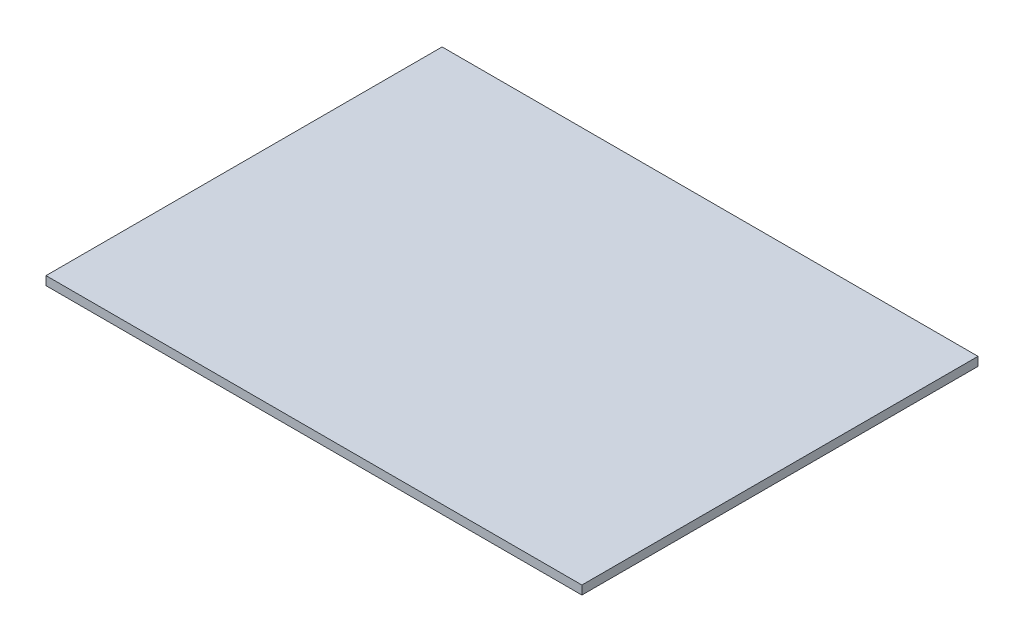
ISO-10303-21;
HEADER;
FILE_DESCRIPTION(('STEP AP214'),'2;1');
FILE_NAME('part.step','',(''),(''),'','','');
FILE_SCHEMA(('AUTOMOTIVE_DESIGN { 1 0 10303 214 1 1 1 1 }'));
ENDSEC;
DATA;
#1=APPLICATION_CONTEXT('core data for automotive mechanical design processes');
#2=APPLICATION_PROTOCOL_DEFINITION('international standard','automotive_design',2000,#1);
#3=PRODUCT_CONTEXT('',#1,'mechanical');
#4=PRODUCT('Part','Part','',(#3));
#5=PRODUCT_RELATED_PRODUCT_CATEGORY('part','',(#4));
#6=PRODUCT_DEFINITION_FORMATION('','',#4);
#7=PRODUCT_DEFINITION_CONTEXT('part definition',#1,'design');
#8=PRODUCT_DEFINITION('design','',#6,#7);
#9=PRODUCT_DEFINITION_SHAPE('','',#8);
#10=(LENGTH_UNIT() NAMED_UNIT(*) SI_UNIT(.MILLI.,.METRE.));
#11=(NAMED_UNIT(*) PLANE_ANGLE_UNIT() SI_UNIT($,.RADIAN.));
#12=(NAMED_UNIT(*) SI_UNIT($,.STERADIAN.) SOLID_ANGLE_UNIT());
#13=UNCERTAINTY_MEASURE_WITH_UNIT(LENGTH_MEASURE(1.E-05),#10,'distance_accuracy_value','');
#14=(GEOMETRIC_REPRESENTATION_CONTEXT(3) GLOBAL_UNCERTAINTY_ASSIGNED_CONTEXT((#13)) GLOBAL_UNIT_ASSIGNED_CONTEXT((#10,
#11,#12)) REPRESENTATION_CONTEXT('',''));
#15=CARTESIAN_POINT('',(0.,0.,0.));
#16=DIRECTION('',(0.,0.,1.));
#17=DIRECTION('',(1.,0.,0.));
#18=AXIS2_PLACEMENT_3D('',#15,#16,#17);
#19=CARTESIAN_POINT('',(0.,19.05,0.));
#20=DIRECTION('',(1.,0.,0.));
#21=DIRECTION('',(0.,0.,-1.));
#22=AXIS2_PLACEMENT_3D('',#19,#20,#21);
#23=PLANE('',#22);
#24=DIRECTION('',(0.,0.,1.));
#25=VECTOR('',#24,1.);
#26=CARTESIAN_POINT('',(0.,0.,0.));
#27=LINE('',#26,#25);
#28=CARTESIAN_POINT('',(0.,0.,-863.6));
#29=VERTEX_POINT('',#28);
#30=CARTESIAN_POINT('',(0.,0.,0.));
#31=VERTEX_POINT('',#30);
#32=EDGE_CURVE('E102',#29,#31,#27,.T.);
#33=ORIENTED_EDGE('',*,*,#32,.T.);
#34=DIRECTION('',(0.,-1.,0.));
#35=VECTOR('',#34,1.);
#36=CARTESIAN_POINT('',(0.,19.05,0.));
#37=LINE('',#36,#35);
#38=CARTESIAN_POINT('',(0.,19.05,0.));
#39=VERTEX_POINT('',#38);
#40=EDGE_CURVE('E11',#39,#31,#37,.T.);
#41=ORIENTED_EDGE('',*,*,#40,.F.);
#42=DIRECTION('',(0.,0.,1.));
#43=VECTOR('',#42,1.);
#44=CARTESIAN_POINT('',(0.,19.05,0.));
#45=LINE('',#44,#43);
#46=CARTESIAN_POINT('',(0.,19.05,-863.6));
#47=VERTEX_POINT('',#46);
#48=EDGE_CURVE('E90',#47,#39,#45,.T.);
#49=ORIENTED_EDGE('',*,*,#48,.F.);
#50=DIRECTION('',(0.,-1.,0.));
#51=VECTOR('',#50,1.);
#52=CARTESIAN_POINT('',(0.,19.05,-863.6));
#53=LINE('',#52,#51);
#54=EDGE_CURVE('E98',#47,#29,#53,.T.);
#55=ORIENTED_EDGE('',*,*,#54,.T.);
#56=EDGE_LOOP('',(#33,#41,#49,#55));
#57=FACE_BOUND('',#56,.T.);
#58=ADVANCED_FACE('F39',(#57),#23,.F.);
#59=CARTESIAN_POINT('',(0.,19.05,0.));
#60=DIRECTION('',(0.,0.,-1.));
#61=DIRECTION('',(-1.,0.,0.));
#62=AXIS2_PLACEMENT_3D('',#59,#60,#61);
#63=PLANE('',#62);
#64=DIRECTION('',(1.,0.,0.));
#65=VECTOR('',#64,1.);
#66=CARTESIAN_POINT('',(0.,0.,0.));
#67=LINE('',#66,#65);
#68=CARTESIAN_POINT('',(1168.4,0.,0.));
#69=VERTEX_POINT('',#68);
#70=EDGE_CURVE('E94',#31,#69,#67,.T.);
#71=ORIENTED_EDGE('',*,*,#70,.T.);
#72=DIRECTION('',(0.,-1.,0.));
#73=VECTOR('',#72,1.);
#74=CARTESIAN_POINT('',(1168.4,19.05,0.));
#75=LINE('',#74,#73);
#76=CARTESIAN_POINT('',(1168.4,19.05,0.));
#77=VERTEX_POINT('',#76);
#78=EDGE_CURVE('E47',#77,#69,#75,.T.);
#79=ORIENTED_EDGE('',*,*,#78,.F.);
#80=DIRECTION('',(1.,0.,0.));
#81=VECTOR('',#80,1.);
#82=CARTESIAN_POINT('',(0.,19.05,0.));
#83=LINE('',#82,#81);
#84=EDGE_CURVE('E85',#39,#77,#83,.T.);
#85=ORIENTED_EDGE('',*,*,#84,.F.);
#86=ORIENTED_EDGE('',*,*,#40,.T.);
#87=EDGE_LOOP('',(#71,#79,#85,#86));
#88=FACE_BOUND('',#87,.T.);
#89=ADVANCED_FACE('F93',(#88),#63,.F.);
#90=CARTESIAN_POINT('',(1168.4,19.05,0.));
#91=DIRECTION('',(-1.,0.,0.));
#92=DIRECTION('',(0.,0.,1.));
#93=AXIS2_PLACEMENT_3D('',#90,#91,#92);
#94=PLANE('',#93);
#95=DIRECTION('',(0.,0.,-1.));
#96=VECTOR('',#95,1.);
#97=CARTESIAN_POINT('',(1168.4,0.,0.));
#98=LINE('',#97,#96);
#99=CARTESIAN_POINT('',(1168.4,0.,-863.6));
#100=VERTEX_POINT('',#99);
#101=EDGE_CURVE('E72',#69,#100,#98,.T.);
#102=ORIENTED_EDGE('',*,*,#101,.T.);
#103=DIRECTION('',(0.,-1.,0.));
#104=VECTOR('',#103,1.);
#105=CARTESIAN_POINT('',(1168.4,19.05,-863.6));
#106=LINE('',#105,#104);
#107=CARTESIAN_POINT('',(1168.4,19.05,-863.6));
#108=VERTEX_POINT('',#107);
#109=EDGE_CURVE('E95',#108,#100,#106,.T.);
#110=ORIENTED_EDGE('',*,*,#109,.F.);
#111=DIRECTION('',(0.,0.,-1.));
#112=VECTOR('',#111,1.);
#113=CARTESIAN_POINT('',(1168.4,19.05,0.));
#114=LINE('',#113,#112);
#115=EDGE_CURVE('E88',#77,#108,#114,.T.);
#116=ORIENTED_EDGE('',*,*,#115,.F.);
#117=ORIENTED_EDGE('',*,*,#78,.T.);
#118=EDGE_LOOP('',(#102,#110,#116,#117));
#119=FACE_BOUND('',#118,.T.);
#120=ADVANCED_FACE('F96',(#119),#94,.F.);
#121=CARTESIAN_POINT('',(0.,19.05,-863.6));
#122=DIRECTION('',(0.,0.,1.));
#123=DIRECTION('',(1.,0.,0.));
#124=AXIS2_PLACEMENT_3D('',#121,#122,#123);
#125=PLANE('',#124);
#126=DIRECTION('',(-1.,0.,0.));
#127=VECTOR('',#126,1.);
#128=CARTESIAN_POINT('',(0.,0.,-863.6));
#129=LINE('',#128,#127);
#130=EDGE_CURVE('E78',#100,#29,#129,.T.);
#131=ORIENTED_EDGE('',*,*,#130,.T.);
#132=ORIENTED_EDGE('',*,*,#54,.F.);
#133=DIRECTION('',(-1.,0.,0.));
#134=VECTOR('',#133,1.);
#135=CARTESIAN_POINT('',(0.,19.05,-863.6));
#136=LINE('',#135,#134);
#137=EDGE_CURVE('E55',#108,#47,#136,.T.);
#138=ORIENTED_EDGE('',*,*,#137,.F.);
#139=ORIENTED_EDGE('',*,*,#109,.T.);
#140=EDGE_LOOP('',(#131,#132,#138,#139));
#141=FACE_BOUND('',#140,.T.);
#142=ADVANCED_FACE('F109',(#141),#125,.F.);
#143=CARTESIAN_POINT('',(0.,19.05,0.));
#144=DIRECTION('',(0.,-1.,0.));
#145=DIRECTION('',(0.,0.,-1.));
#146=AXIS2_PLACEMENT_3D('',#143,#144,#145);
#147=PLANE('',#146);
#148=ORIENTED_EDGE('',*,*,#48,.T.);
#149=ORIENTED_EDGE('',*,*,#84,.T.);
#150=ORIENTED_EDGE('',*,*,#115,.T.);
#151=ORIENTED_EDGE('',*,*,#137,.T.);
#152=EDGE_LOOP('',(#148,#149,#150,#151));
#153=FACE_BOUND('',#152,.T.);
#154=ADVANCED_FACE('F86',(#153),#147,.F.);
#155=CARTESIAN_POINT('',(0.,0.,0.));
#156=DIRECTION('',(0.,-1.,0.));
#157=DIRECTION('',(0.,0.,-1.));
#158=AXIS2_PLACEMENT_3D('',#155,#156,#157);
#159=PLANE('',#158);
#160=ORIENTED_EDGE('',*,*,#32,.F.);
#161=ORIENTED_EDGE('',*,*,#130,.F.);
#162=ORIENTED_EDGE('',*,*,#101,.F.);
#163=ORIENTED_EDGE('',*,*,#70,.F.);
#164=EDGE_LOOP('',(#160,#161,#162,#163));
#165=FACE_BOUND('',#164,.T.);
#166=ADVANCED_FACE('F112',(#165),#159,.T.);
#167=CLOSED_SHELL('',(#58,#89,#120,#142,#154,#166));
#168=MANIFOLD_SOLID_BREP('B2',#167);
#169=ADVANCED_BREP_SHAPE_REPRESENTATION('',(#18,#168),#14);
#170=SHAPE_DEFINITION_REPRESENTATION(#9,#169);
ENDSEC;
END-ISO-10303-21;
